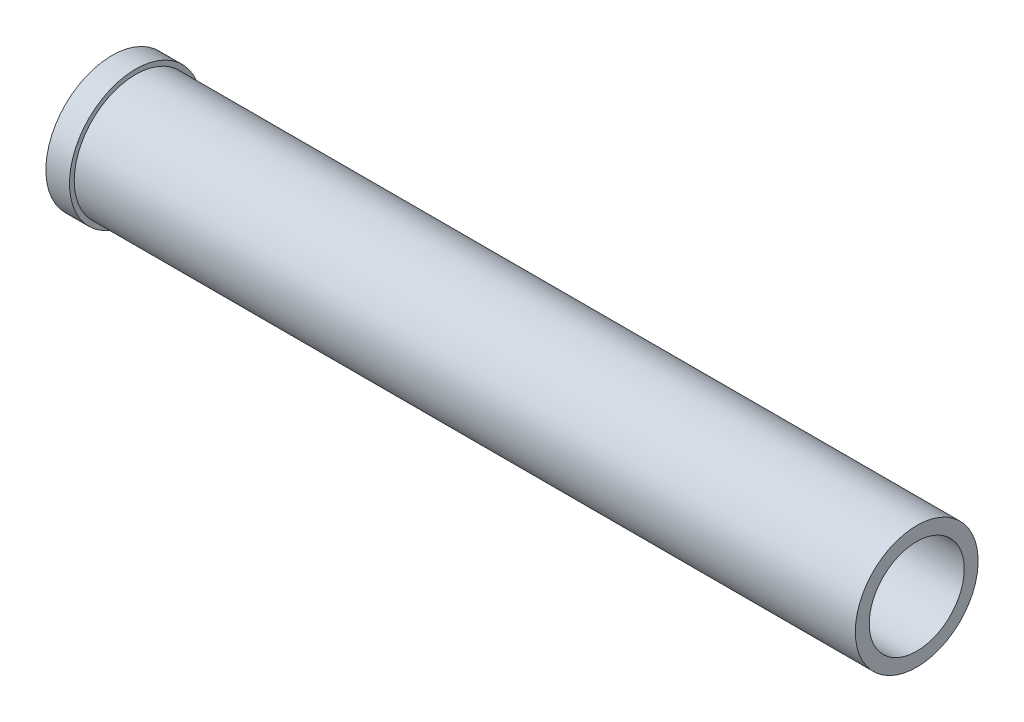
ISO-10303-21;
HEADER;
FILE_DESCRIPTION(('STEP AP214'),'2;1');
FILE_NAME('part.step','',(''),(''),'','','');
FILE_SCHEMA(('AUTOMOTIVE_DESIGN { 1 0 10303 214 1 1 1 1 }'));
ENDSEC;
DATA;
#1=APPLICATION_CONTEXT('core data for automotive mechanical design processes');
#2=APPLICATION_PROTOCOL_DEFINITION('international standard','automotive_design',2000,#1);
#3=PRODUCT_CONTEXT('',#1,'mechanical');
#4=PRODUCT('Part','Part','',(#3));
#5=PRODUCT_RELATED_PRODUCT_CATEGORY('part','',(#4));
#6=PRODUCT_DEFINITION_FORMATION('','',#4);
#7=PRODUCT_DEFINITION_CONTEXT('part definition',#1,'design');
#8=PRODUCT_DEFINITION('design','',#6,#7);
#9=PRODUCT_DEFINITION_SHAPE('','',#8);
#10=(LENGTH_UNIT() NAMED_UNIT(*) SI_UNIT(.MILLI.,.METRE.));
#11=(NAMED_UNIT(*) PLANE_ANGLE_UNIT() SI_UNIT($,.RADIAN.));
#12=(NAMED_UNIT(*) SI_UNIT($,.STERADIAN.) SOLID_ANGLE_UNIT());
#13=UNCERTAINTY_MEASURE_WITH_UNIT(LENGTH_MEASURE(1.E-05),#10,'distance_accuracy_value','');
#14=(GEOMETRIC_REPRESENTATION_CONTEXT(3) GLOBAL_UNCERTAINTY_ASSIGNED_CONTEXT((#13)) GLOBAL_UNIT_ASSIGNED_CONTEXT((#10,
#11,#12)) REPRESENTATION_CONTEXT('',''));
#15=CARTESIAN_POINT('',(0.,0.,0.));
#16=DIRECTION('',(0.,0.,1.));
#17=DIRECTION('',(1.,0.,0.));
#18=AXIS2_PLACEMENT_3D('',#15,#16,#17);
#19=CARTESIAN_POINT('',(25.,0.,0.));
#20=DIRECTION('',(-1.,0.,0.));
#21=DIRECTION('',(0.,0.,1.));
#22=AXIS2_PLACEMENT_3D('',#19,#20,#21);
#23=CYLINDRICAL_SURFACE('',#22,70.);
#24=CARTESIAN_POINT('',(25.,0.,0.));
#25=DIRECTION('',(1.,0.,0.));
#26=DIRECTION('',(0.,0.,-1.));
#27=AXIS2_PLACEMENT_3D('',#24,#25,#26);
#28=CIRCLE('',#27,70.);
#29=CARTESIAN_POINT('',(25.,0.,-70.));
#30=VERTEX_POINT('',#29);
#31=EDGE_CURVE('E36',#30,#30,#28,.T.);
#32=ORIENTED_EDGE('',*,*,#31,.F.);
#33=EDGE_LOOP('',(#32));
#34=FACE_BOUND('',#33,.T.);
#35=CARTESIAN_POINT('',(0.,0.,0.));
#36=DIRECTION('',(1.,0.,0.));
#37=DIRECTION('',(0.,0.,-1.));
#38=AXIS2_PLACEMENT_3D('',#35,#36,#37);
#39=CIRCLE('',#38,70.);
#40=CARTESIAN_POINT('',(0.,0.,-70.));
#41=VERTEX_POINT('',#40);
#42=EDGE_CURVE('E41',#41,#41,#39,.T.);
#43=ORIENTED_EDGE('',*,*,#42,.T.);
#44=EDGE_LOOP('',(#43));
#45=FACE_BOUND('',#44,.T.);
#46=ADVANCED_FACE('F29',(#34,#45),#23,.T.);
#47=CARTESIAN_POINT('',(25.,0.,0.));
#48=DIRECTION('',(1.,0.,0.));
#49=DIRECTION('',(0.,0.,-1.));
#50=AXIS2_PLACEMENT_3D('',#47,#48,#49);
#51=PLANE('',#50);
#52=CARTESIAN_POINT('',(25.,0.,0.));
#53=DIRECTION('',(1.,0.,0.));
#54=DIRECTION('',(0.,0.,-1.));
#55=AXIS2_PLACEMENT_3D('',#52,#53,#54);
#56=CIRCLE('',#55,65.);
#57=CARTESIAN_POINT('',(25.,0.,-65.));
#58=VERTEX_POINT('',#57);
#59=EDGE_CURVE('E10',#58,#58,#56,.T.);
#60=ORIENTED_EDGE('',*,*,#59,.F.);
#61=EDGE_LOOP('',(#60));
#62=FACE_BOUND('',#61,.T.);
#63=ORIENTED_EDGE('',*,*,#31,.T.);
#64=EDGE_LOOP('',(#63));
#65=FACE_BOUND('',#64,.T.);
#66=ADVANCED_FACE('F82',(#62,#65),#51,.T.);
#67=CARTESIAN_POINT('',(0.,0.,0.));
#68=DIRECTION('',(1.,0.,0.));
#69=DIRECTION('',(0.,0.,-1.));
#70=AXIS2_PLACEMENT_3D('',#67,#68,#69);
#71=PLANE('',#70);
#72=CARTESIAN_POINT('',(0.,0.,0.));
#73=DIRECTION('',(-1.,0.,0.));
#74=DIRECTION('',(0.,0.,1.));
#75=AXIS2_PLACEMENT_3D('',#72,#73,#74);
#76=CIRCLE('',#75,64.);
#77=CARTESIAN_POINT('',(1.11022302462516E-13,0.,64.));
#78=VERTEX_POINT('',#77);
#79=EDGE_CURVE('E54',#78,#78,#76,.T.);
#80=ORIENTED_EDGE('',*,*,#79,.F.);
#81=EDGE_LOOP('',(#80));
#82=FACE_BOUND('',#81,.T.);
#83=ORIENTED_EDGE('',*,*,#42,.F.);
#84=EDGE_LOOP('',(#83));
#85=FACE_BOUND('',#84,.T.);
#86=ADVANCED_FACE('F87',(#82,#85),#71,.F.);
#87=CARTESIAN_POINT('',(852.,0.,0.));
#88=DIRECTION('',(-1.,0.,0.));
#89=DIRECTION('',(0.,0.,1.));
#90=AXIS2_PLACEMENT_3D('',#87,#88,#89);
#91=CYLINDRICAL_SURFACE('',#90,65.);
#92=ORIENTED_EDGE('',*,*,#59,.T.);
#93=EDGE_LOOP('',(#92));
#94=FACE_BOUND('',#93,.T.);
#95=CARTESIAN_POINT('',(852.,0.,0.));
#96=DIRECTION('',(-1.,0.,0.));
#97=DIRECTION('',(0.,0.,1.));
#98=AXIS2_PLACEMENT_3D('',#95,#96,#97);
#99=CIRCLE('',#98,65.);
#100=CARTESIAN_POINT('',(852.,0.,65.));
#101=VERTEX_POINT('',#100);
#102=EDGE_CURVE('E44',#101,#101,#99,.T.);
#103=ORIENTED_EDGE('',*,*,#102,.T.);
#104=EDGE_LOOP('',(#103));
#105=FACE_BOUND('',#104,.T.);
#106=ADVANCED_FACE('F95',(#94,#105),#91,.T.);
#107=CARTESIAN_POINT('',(852.,0.,0.));
#108=DIRECTION('',(-1.,0.,0.));
#109=DIRECTION('',(0.,0.,1.));
#110=AXIS2_PLACEMENT_3D('',#107,#108,#109);
#111=PLANE('',#110);
#112=CARTESIAN_POINT('',(852.,0.,0.));
#113=DIRECTION('',(1.,0.,0.));
#114=DIRECTION('',(0.,0.,-1.));
#115=AXIS2_PLACEMENT_3D('',#112,#113,#114);
#116=CIRCLE('',#115,50.3);
#117=CARTESIAN_POINT('',(852.,0.,-50.3));
#118=VERTEX_POINT('',#117);
#119=EDGE_CURVE('E60',#118,#118,#116,.T.);
#120=ORIENTED_EDGE('',*,*,#119,.F.);
#121=EDGE_LOOP('',(#120));
#122=FACE_BOUND('',#121,.T.);
#123=ORIENTED_EDGE('',*,*,#102,.F.);
#124=EDGE_LOOP('',(#123));
#125=FACE_BOUND('',#124,.T.);
#126=ADVANCED_FACE('F78',(#122,#125),#111,.F.);
#127=CARTESIAN_POINT('',(730.,0.,0.));
#128=DIRECTION('',(-1.,0.,0.));
#129=DIRECTION('',(0.,0.,1.));
#130=AXIS2_PLACEMENT_3D('',#127,#128,#129);
#131=CYLINDRICAL_SURFACE('',#130,64.);
#132=CARTESIAN_POINT('',(730.,0.,0.));
#133=DIRECTION('',(-1.,0.,0.));
#134=DIRECTION('',(0.,0.,1.));
#135=AXIS2_PLACEMENT_3D('',#132,#133,#134);
#136=CIRCLE('',#135,64.);
#137=CARTESIAN_POINT('',(730.,0.,64.));
#138=VERTEX_POINT('',#137);
#139=EDGE_CURVE('E50',#138,#138,#136,.T.);
#140=CARTESIAN_POINT('',(730.,0.,64.));
#141=CARTESIAN_POINT('',(722.395833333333,0.,64.));
#142=CARTESIAN_POINT('',(714.791666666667,0.,64.));
#143=CARTESIAN_POINT('',(699.583333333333,0.,64.));
#144=CARTESIAN_POINT('',(691.979166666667,0.,64.));
#145=CARTESIAN_POINT('',(676.770833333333,0.,64.));
#146=CARTESIAN_POINT('',(669.166666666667,0.,64.));
#147=CARTESIAN_POINT('',(653.958333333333,0.,64.));
#148=CARTESIAN_POINT('',(646.354166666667,0.,64.));
#149=CARTESIAN_POINT('',(631.145833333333,0.,64.));
#150=CARTESIAN_POINT('',(623.541666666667,0.,64.));
#151=CARTESIAN_POINT('',(608.333333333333,0.,64.));
#152=CARTESIAN_POINT('',(600.729166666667,0.,64.));
#153=CARTESIAN_POINT('',(585.520833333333,0.,64.));
#154=CARTESIAN_POINT('',(577.916666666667,0.,64.));
#155=CARTESIAN_POINT('',(562.708333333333,0.,64.));
#156=CARTESIAN_POINT('',(555.104166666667,0.,64.));
#157=CARTESIAN_POINT('',(539.895833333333,0.,64.));
#158=CARTESIAN_POINT('',(532.291666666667,0.,64.));
#159=CARTESIAN_POINT('',(517.083333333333,0.,64.));
#160=CARTESIAN_POINT('',(509.479166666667,0.,64.));
#161=CARTESIAN_POINT('',(494.270833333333,0.,64.));
#162=CARTESIAN_POINT('',(486.666666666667,0.,64.));
#163=CARTESIAN_POINT('',(471.458333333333,0.,64.));
#164=CARTESIAN_POINT('',(463.854166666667,0.,64.));
#165=CARTESIAN_POINT('',(448.645833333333,0.,64.));
#166=CARTESIAN_POINT('',(441.041666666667,0.,64.));
#167=CARTESIAN_POINT('',(425.833333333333,0.,64.));
#168=CARTESIAN_POINT('',(418.229166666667,0.,64.));
#169=CARTESIAN_POINT('',(403.020833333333,0.,64.));
#170=CARTESIAN_POINT('',(395.416666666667,0.,64.));
#171=CARTESIAN_POINT('',(380.208333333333,0.,64.));
#172=CARTESIAN_POINT('',(372.604166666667,0.,64.));
#173=CARTESIAN_POINT('',(357.395833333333,0.,64.));
#174=CARTESIAN_POINT('',(349.791666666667,0.,64.));
#175=CARTESIAN_POINT('',(334.583333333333,0.,64.));
#176=CARTESIAN_POINT('',(326.979166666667,0.,64.));
#177=CARTESIAN_POINT('',(311.770833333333,0.,64.));
#178=CARTESIAN_POINT('',(304.166666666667,0.,64.));
#179=CARTESIAN_POINT('',(288.958333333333,0.,64.));
#180=CARTESIAN_POINT('',(281.354166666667,0.,64.));
#181=CARTESIAN_POINT('',(266.145833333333,0.,64.));
#182=CARTESIAN_POINT('',(258.541666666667,0.,64.));
#183=CARTESIAN_POINT('',(243.333333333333,0.,64.));
#184=CARTESIAN_POINT('',(235.729166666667,0.,64.));
#185=CARTESIAN_POINT('',(220.520833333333,0.,64.));
#186=CARTESIAN_POINT('',(212.916666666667,0.,64.));
#187=CARTESIAN_POINT('',(197.708333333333,0.,64.));
#188=CARTESIAN_POINT('',(190.104166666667,0.,64.));
#189=CARTESIAN_POINT('',(174.895833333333,0.,64.));
#190=CARTESIAN_POINT('',(167.291666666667,0.,64.));
#191=CARTESIAN_POINT('',(152.083333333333,0.,64.));
#192=CARTESIAN_POINT('',(144.479166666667,0.,64.));
#193=CARTESIAN_POINT('',(129.270833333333,0.,64.));
#194=CARTESIAN_POINT('',(121.666666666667,0.,64.));
#195=CARTESIAN_POINT('',(106.458333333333,0.,64.));
#196=CARTESIAN_POINT('',(98.8541666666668,0.,64.));
#197=CARTESIAN_POINT('',(83.6458333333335,0.,64.));
#198=CARTESIAN_POINT('',(76.0416666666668,0.,64.));
#199=CARTESIAN_POINT('',(60.8333333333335,0.,64.));
#200=CARTESIAN_POINT('',(53.2291666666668,0.,64.));
#201=CARTESIAN_POINT('',(38.0208333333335,0.,64.));
#202=CARTESIAN_POINT('',(30.4166666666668,0.,64.));
#203=CARTESIAN_POINT('',(15.2083333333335,0.,64.));
#204=CARTESIAN_POINT('',(7.60416666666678,0.,64.));
#205=CARTESIAN_POINT('',(1.11022302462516E-13,0.,64.));
#206=B_SPLINE_CURVE_WITH_KNOTS('',3,(#140,#141,#142,#143,#144,#145,#146,#147,#148,#149,#150,
#151,#152,#153,#154,#155,#156,#157,#158,#159,#160,#161,#162,#163,#164,#165,#166,#167,#168,#169,
#170,#171,#172,#173,#174,#175,#176,#177,#178,#179,#180,#181,#182,#183,#184,#185,#186,#187,#188,
#189,#190,#191,#192,#193,#194,#195,#196,#197,#198,#199,#200,#201,#202,#203,#204,#205),
.UNSPECIFIED.,.F.,.F.,(4,2,2,2,2,2,2,2,2,2,2,2,2,2,2,2,2,2,2,2,2,2,2,2,2,2,2,2,2,2,2,2,4),(0.,
22.8125,45.625,68.4375,91.2500000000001,114.0625,136.875,159.6875,182.5,205.3125,228.125,
250.9375,273.75,296.5625,319.375,342.1875,365.,387.8125,410.625,433.4375,456.25,479.0625,
501.875,524.6875,547.5,570.3125,593.125,615.9375,638.75,661.5625,684.375,707.1875,730.),.UNSPECIFIED.);
#207=EDGE_CURVE('BSEAM71',#138,#78,#206,.T.);
#208=ORIENTED_EDGE('',*,*,#139,.F.);
#209=ORIENTED_EDGE('',*,*,#79,.T.);
#210=ORIENTED_EDGE('',*,*,#207,.T.);
#211=ORIENTED_EDGE('',*,*,#207,.F.);
#212=EDGE_LOOP('',(#208,#210,#209,#211));
#213=FACE_BOUND('',#212,.T.);
#214=ADVANCED_FACE('F71',(#213),#131,.F.);
#215=CARTESIAN_POINT('',(730.,0.,0.));
#216=DIRECTION('',(-1.,0.,0.));
#217=DIRECTION('',(0.,0.,1.));
#218=AXIS2_PLACEMENT_3D('',#215,#216,#217);
#219=PLANE('',#218);
#220=CARTESIAN_POINT('',(730.,0.,0.));
#221=DIRECTION('',(-1.,0.,0.));
#222=DIRECTION('',(0.,0.,1.));
#223=AXIS2_PLACEMENT_3D('',#220,#221,#222);
#224=CIRCLE('',#223,50.3);
#225=CARTESIAN_POINT('',(730.,0.,50.3));
#226=VERTEX_POINT('',#225);
#227=EDGE_CURVE('E32',#226,#226,#224,.T.);
#228=ORIENTED_EDGE('',*,*,#227,.F.);
#229=EDGE_LOOP('',(#228));
#230=FACE_BOUND('',#229,.T.);
#231=ORIENTED_EDGE('',*,*,#139,.T.);
#232=EDGE_LOOP('',(#231));
#233=FACE_BOUND('',#232,.T.);
#234=ADVANCED_FACE('F69',(#230,#233),#219,.T.);
#235=CARTESIAN_POINT('',(0.,0.,0.));
#236=DIRECTION('',(1.,0.,0.));
#237=DIRECTION('',(0.,0.,-1.));
#238=AXIS2_PLACEMENT_3D('',#235,#236,#237);
#239=CYLINDRICAL_SURFACE('',#238,50.3);
#240=ORIENTED_EDGE('',*,*,#227,.T.);
#241=EDGE_LOOP('',(#240));
#242=FACE_BOUND('',#241,.T.);
#243=ORIENTED_EDGE('',*,*,#119,.T.);
#244=EDGE_LOOP('',(#243));
#245=FACE_BOUND('',#244,.T.);
#246=ADVANCED_FACE('F67',(#242,#245),#239,.F.);
#247=CLOSED_SHELL('',(#46,#66,#86,#106,#126,#214,#234,#246));
#248=MANIFOLD_SOLID_BREP('B2',#247);
#249=ADVANCED_BREP_SHAPE_REPRESENTATION('',(#18,#248),#14);
#250=SHAPE_DEFINITION_REPRESENTATION(#9,#249);
ENDSEC;
END-ISO-10303-21;
